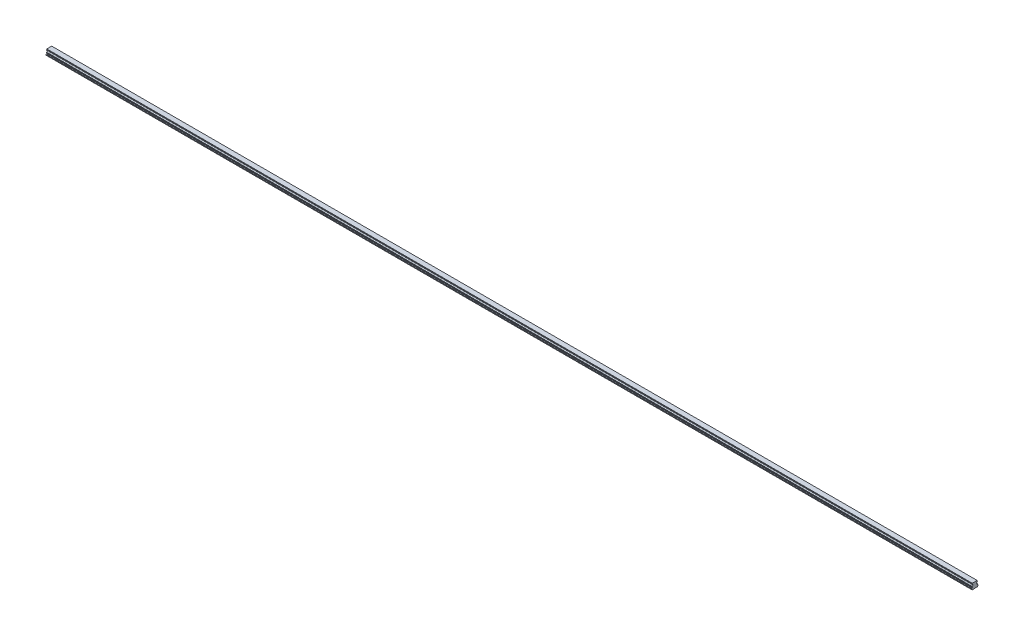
from build123d import *

# Parameters (mm, degrees)
BOSS_EXTRUDE1_DEPTH        = 3540
SKETCH3_R                  = 3
SKETCH3_R_2                = 2.5
CUT_EXTRUDE3_DEPTH         = 12
SKETCH3_2_R                = 2.5
CUT_EXTRUDE4_DEPTH         = 15
CHAMFER1_SIZE              = 0.5
LPATTERN4_COUNT            = 59
LPATTERN4_PITCH            = 60
CHAMFER1_OF_LPATTERN4_SIZE = 0.5


with BuildPart() as part:
    # Sketch1 → Boss-Extrude1 (new body)
    with BuildSketch(Plane(origin=(0, 0, 0), x_dir=(0, 0, -1), z_dir=(1, 0, 0))):
        with BuildLine():
            Line((9.375, 21.8), (-9.375, 21.8))
            Line((-9.375, 21.8), (-9.375, 20.756))
            Line((-9.375, 20.756), (-10, 19.415683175))
            Line((-10, 19.415683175), (-10, 17.685449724))
            ThreePointArc((-10, 17.685449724), (-7.2, 14.6), (-10, 11.514550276))
            Line((-10, 11.514550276), (-10, 9.784316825))
            Line((-10, 9.784316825), (-9.375, 8.444))
            Line((-9.375, 8.444), (-9.922688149, 6.4))
            Line((-9.922688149, 6.4), (-12.5, 5.489338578))
            Line((-12.5, 5.489338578), (-12.5, 2.65))
            Line((-12.5, 2.65), (-9.85, 0))
            Line((-9.85, 0), (-5.5, 0))
            Line((-5.5, 0), (-5, 0.5))
            Line((-5, 0.5), (5, 0.5))
            Line((5, 0.5), (5.5, 0))
            Line((5.5, 0), (9.85, 0))
            Line((9.85, 0), (12.5, 2.65))
            Line((12.5, 2.65), (12.5, 5.489338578))
            Line((12.5, 5.489338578), (9.922688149, 6.4))
            Line((9.922688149, 6.4), (9.375, 8.444))
            Line((9.375, 8.444), (10, 9.784316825))
            Line((10, 9.784316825), (10, 11.514550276))
            ThreePointArc((10, 11.514550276), (7.2, 14.6), (10, 17.685449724))
            Line((10, 17.685449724), (10, 19.415683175))
            Line((10, 19.415683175), (9.375, 20.756))
            Line((9.375, 20.756), (9.375, 21.8))
        make_face()
    extrude(amount=BOSS_EXTRUDE1_DEPTH)

    # Sketch3 → Cut-Extrude3 (cut)
    with BuildSketch(Plane.XZ):
        with Locations(Location((30, 0, 0), (0, 0, 270))):
            Circle(SKETCH3_R)
        with Locations(Location((30, 0, 0), (0, 0, 270))):
            Circle(SKETCH3_R_2, mode=Mode.SUBTRACT)
    cut_extrude3 = extrude(amount=-CUT_EXTRUDE3_DEPTH, mode=Mode.SUBTRACT)

    # Sketch3_2 → Cut-Extrude4 (cut)
    with BuildSketch(Plane.XZ):
        with Locations(Location((30, 0, 0), (0, 0, 270))):
            Circle(SKETCH3_2_R)
    cut_extrude4 = extrude(amount=-CUT_EXTRUDE4_DEPTH, mode=Mode.SUBTRACT)

    # Cut-Extrude5 cone 1 section (on through the dimple's axis) → Cut-Extrude5 (revolve, cut)
    with BuildSketch(Plane(origin=(30, 15, 0), x_dir=(0, 0, -1), z_dir=(1, 0, 0))):
        Polygon((0, 0), (2.5, 0), (0, 1.443375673), align=None)
    cut_extrude5 = revolve(axis=Axis((30, 15, 0), (0, 1, 0)), mode=Mode.SUBTRACT)

    # Chamfer1
    chamfer1_edges = [part.edges().sort_by_distance(p)[0] for p in [
        (30, 0.5, 3),
    ]]
    chamfer(chamfer1_edges, length=CHAMFER1_SIZE)

    # LPattern4: Cut-Extrude3, Cut-Extrude4, Cut-Extrude5 ×59
    with Locations(*[(i * LPATTERN4_PITCH, 0, 0) for i in range(1, LPATTERN4_COUNT)]):
        add(cut_extrude3, mode=Mode.SUBTRACT)
        add(cut_extrude4, mode=Mode.SUBTRACT)
        add(cut_extrude5, mode=Mode.SUBTRACT)

    # Chamfer1 of LPattern4
    chamfer1_of_lpattern4_edges = [part.edges().sort_by_distance(p)[0] for p in [
        (90, 0.5, 3),
        (150, 0.5, 3),
        (210, 0.5, 3),
        (270, 0.5, 3),
        (330, 0.5, 3),
        (390, 0.5, 3),
        (450, 0.5, 3),
        (510, 0.5, 3),
        (570, 0.5, 3),
        (630, 0.5, 3),
        (690, 0.5, 3),
        (750, 0.5, 3),
        (810, 0.5, 3),
        (870, 0.5, 3),
        (930, 0.5, 3),
        (990, 0.5, 3),
        (1050, 0.5, 3),
        (1110, 0.5, 3),
        (1170, 0.5, 3),
        (1230, 0.5, 3),
        (1290, 0.5, 3),
        (1350, 0.5, 3),
        (1410, 0.5, 3),
        (1470, 0.5, 3),
        (1530, 0.5, 3),
        (1590, 0.5, 3),
        (1650, 0.5, 3),
        (1710, 0.5, 3),
        (1770, 0.5, 3),
        (1830, 0.5, 3),
        (1890, 0.5, 3),
        (1950, 0.5, 3),
        (2010, 0.5, 3),
        (2070, 0.5, 3),
        (2130, 0.5, 3),
        (2190, 0.5, 3),
        (2250, 0.5, 3),
        (2310, 0.5, 3),
        (2370, 0.5, 3),
        (2430, 0.5, 3),
        (2490, 0.5, 3),
        (2550, 0.5, 3),
        (2610, 0.5, 3),
        (2670, 0.5, 3),
        (2730, 0.5, 3),
        (2790, 0.5, 3),
        (2850, 0.5, 3),
        (2910, 0.5, 3),
        (2970, 0.5, 3),
        (3030, 0.5, 3),
        (3090, 0.5, 3),
        (3150, 0.5, 3),
        (3210, 0.5, 3),
        (3270, 0.5, 3),
        (3330, 0.5, 3),
        (3390, 0.5, 3),
        (3450, 0.5, 3),
        (3510, 0.5, 3),
    ]]
    chamfer(chamfer1_of_lpattern4_edges, length=CHAMFER1_OF_LPATTERN4_SIZE)


solid = part.part
